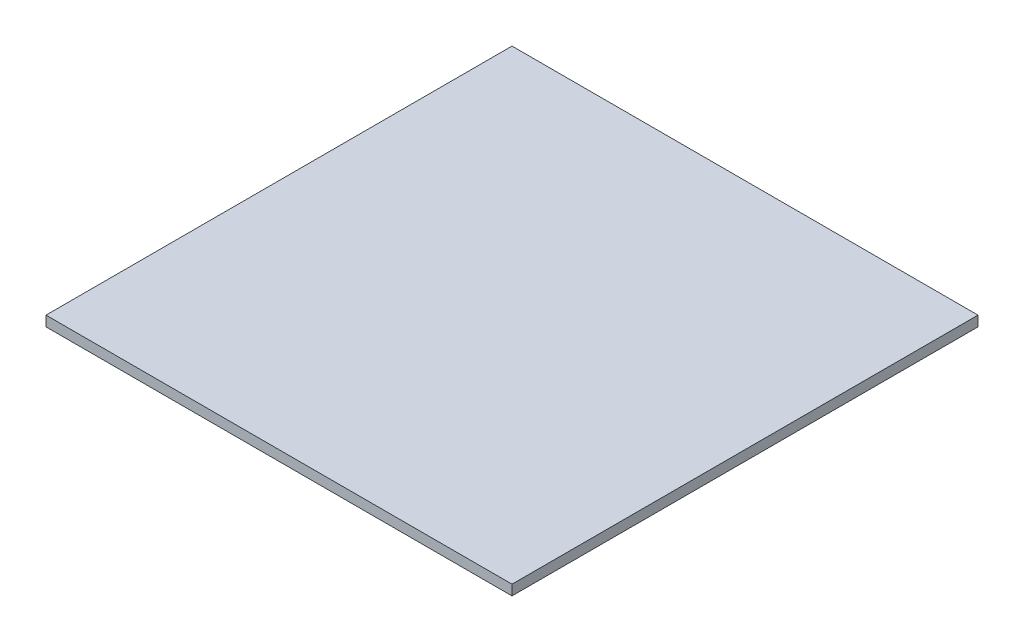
ISO-10303-21;
HEADER;
FILE_DESCRIPTION(('STEP AP214'),'2;1');
FILE_NAME('part.step','',(''),(''),'','','');
FILE_SCHEMA(('AUTOMOTIVE_DESIGN { 1 0 10303 214 1 1 1 1 }'));
ENDSEC;
DATA;
#1=APPLICATION_CONTEXT('core data for automotive mechanical design processes');
#2=APPLICATION_PROTOCOL_DEFINITION('international standard','automotive_design',2000,#1);
#3=PRODUCT_CONTEXT('',#1,'mechanical');
#4=PRODUCT('Part','Part','',(#3));
#5=PRODUCT_RELATED_PRODUCT_CATEGORY('part','',(#4));
#6=PRODUCT_DEFINITION_FORMATION('','',#4);
#7=PRODUCT_DEFINITION_CONTEXT('part definition',#1,'design');
#8=PRODUCT_DEFINITION('design','',#6,#7);
#9=PRODUCT_DEFINITION_SHAPE('','',#8);
#10=(LENGTH_UNIT() NAMED_UNIT(*) SI_UNIT(.MILLI.,.METRE.));
#11=(NAMED_UNIT(*) PLANE_ANGLE_UNIT() SI_UNIT($,.RADIAN.));
#12=(NAMED_UNIT(*) SI_UNIT($,.STERADIAN.) SOLID_ANGLE_UNIT());
#13=UNCERTAINTY_MEASURE_WITH_UNIT(LENGTH_MEASURE(1.E-05),#10,'distance_accuracy_value','');
#14=(GEOMETRIC_REPRESENTATION_CONTEXT(3) GLOBAL_UNCERTAINTY_ASSIGNED_CONTEXT((#13)) GLOBAL_UNIT_ASSIGNED_CONTEXT((#10,
#11,#12)) REPRESENTATION_CONTEXT('',''));
#15=CARTESIAN_POINT('',(0.,0.,0.));
#16=DIRECTION('',(0.,0.,1.));
#17=DIRECTION('',(1.,0.,0.));
#18=AXIS2_PLACEMENT_3D('',#15,#16,#17);
#19=CARTESIAN_POINT('',(-114.3,5.,114.3));
#20=DIRECTION('',(1.,0.,0.));
#21=DIRECTION('',(0.,0.,-1.));
#22=AXIS2_PLACEMENT_3D('',#19,#20,#21);
#23=PLANE('',#22);
#24=DIRECTION('',(0.,0.,1.));
#25=VECTOR('',#24,1.);
#26=CARTESIAN_POINT('',(-114.3,0.,114.3));
#27=LINE('',#26,#25);
#28=CARTESIAN_POINT('',(-114.3,0.,-114.3));
#29=VERTEX_POINT('',#28);
#30=CARTESIAN_POINT('',(-114.3,0.,114.3));
#31=VERTEX_POINT('',#30);
#32=EDGE_CURVE('E113',#29,#31,#27,.T.);
#33=ORIENTED_EDGE('',*,*,#32,.T.);
#34=DIRECTION('',(0.,-1.,0.));
#35=VECTOR('',#34,1.);
#36=CARTESIAN_POINT('',(-114.3,5.,114.3));
#37=LINE('',#36,#35);
#38=CARTESIAN_POINT('',(-114.3,5.,114.3));
#39=VERTEX_POINT('',#38);
#40=EDGE_CURVE('E11',#39,#31,#37,.T.);
#41=ORIENTED_EDGE('',*,*,#40,.F.);
#42=DIRECTION('',(0.,0.,1.));
#43=VECTOR('',#42,1.);
#44=CARTESIAN_POINT('',(-114.3,5.,114.3));
#45=LINE('',#44,#43);
#46=CARTESIAN_POINT('',(-114.3,5.,-114.3));
#47=VERTEX_POINT('',#46);
#48=EDGE_CURVE('E97',#47,#39,#45,.T.);
#49=ORIENTED_EDGE('',*,*,#48,.F.);
#50=DIRECTION('',(0.,-1.,0.));
#51=VECTOR('',#50,1.);
#52=CARTESIAN_POINT('',(-114.3,5.,-114.3));
#53=LINE('',#52,#51);
#54=EDGE_CURVE('E109',#47,#29,#53,.T.);
#55=ORIENTED_EDGE('',*,*,#54,.T.);
#56=EDGE_LOOP('',(#33,#41,#49,#55));
#57=FACE_BOUND('',#56,.T.);
#58=ADVANCED_FACE('F45',(#57),#23,.F.);
#59=CARTESIAN_POINT('',(114.3,5.,114.3));
#60=DIRECTION('',(0.,0.,-1.));
#61=DIRECTION('',(-1.,0.,0.));
#62=AXIS2_PLACEMENT_3D('',#59,#60,#61);
#63=PLANE('',#62);
#64=DIRECTION('',(1.,0.,0.));
#65=VECTOR('',#64,1.);
#66=CARTESIAN_POINT('',(114.3,0.,114.3));
#67=LINE('',#66,#65);
#68=CARTESIAN_POINT('',(114.3,0.,114.3));
#69=VERTEX_POINT('',#68);
#70=EDGE_CURVE('E102',#31,#69,#67,.T.);
#71=ORIENTED_EDGE('',*,*,#70,.T.);
#72=DIRECTION('',(0.,-1.,0.));
#73=VECTOR('',#72,1.);
#74=CARTESIAN_POINT('',(114.3,5.,114.3));
#75=LINE('',#74,#73);
#76=CARTESIAN_POINT('',(114.3,5.,114.3));
#77=VERTEX_POINT('',#76);
#78=EDGE_CURVE('E54',#77,#69,#75,.T.);
#79=ORIENTED_EDGE('',*,*,#78,.F.);
#80=DIRECTION('',(1.,0.,0.));
#81=VECTOR('',#80,1.);
#82=CARTESIAN_POINT('',(114.3,5.,114.3));
#83=LINE('',#82,#81);
#84=EDGE_CURVE('E92',#39,#77,#83,.T.);
#85=ORIENTED_EDGE('',*,*,#84,.F.);
#86=ORIENTED_EDGE('',*,*,#40,.T.);
#87=EDGE_LOOP('',(#71,#79,#85,#86));
#88=FACE_BOUND('',#87,.T.);
#89=ADVANCED_FACE('F101',(#88),#63,.F.);
#90=CARTESIAN_POINT('',(114.3,5.,114.3));
#91=DIRECTION('',(-1.,0.,0.));
#92=DIRECTION('',(0.,0.,1.));
#93=AXIS2_PLACEMENT_3D('',#90,#91,#92);
#94=PLANE('',#93);
#95=DIRECTION('',(0.,0.,-1.));
#96=VECTOR('',#95,1.);
#97=CARTESIAN_POINT('',(114.3,0.,114.3));
#98=LINE('',#97,#96);
#99=CARTESIAN_POINT('',(114.3,0.,-114.3));
#100=VERTEX_POINT('',#99);
#101=EDGE_CURVE('E79',#69,#100,#98,.T.);
#102=ORIENTED_EDGE('',*,*,#101,.T.);
#103=DIRECTION('',(0.,-1.,0.));
#104=VECTOR('',#103,1.);
#105=CARTESIAN_POINT('',(114.3,5.,-114.3));
#106=LINE('',#105,#104);
#107=CARTESIAN_POINT('',(114.3,5.,-114.3));
#108=VERTEX_POINT('',#107);
#109=EDGE_CURVE('E104',#108,#100,#106,.T.);
#110=ORIENTED_EDGE('',*,*,#109,.F.);
#111=DIRECTION('',(0.,0.,-1.));
#112=VECTOR('',#111,1.);
#113=CARTESIAN_POINT('',(114.3,5.,114.3));
#114=LINE('',#113,#112);
#115=EDGE_CURVE('E95',#77,#108,#114,.T.);
#116=ORIENTED_EDGE('',*,*,#115,.F.);
#117=ORIENTED_EDGE('',*,*,#78,.T.);
#118=EDGE_LOOP('',(#102,#110,#116,#117));
#119=FACE_BOUND('',#118,.T.);
#120=ADVANCED_FACE('F105',(#119),#94,.F.);
#121=CARTESIAN_POINT('',(114.3,5.,-114.3));
#122=DIRECTION('',(0.,0.,1.));
#123=DIRECTION('',(1.,0.,0.));
#124=AXIS2_PLACEMENT_3D('',#121,#122,#123);
#125=PLANE('',#124);
#126=DIRECTION('',(-1.,0.,0.));
#127=VECTOR('',#126,1.);
#128=CARTESIAN_POINT('',(114.3,0.,-114.3));
#129=LINE('',#128,#127);
#130=EDGE_CURVE('E85',#100,#29,#129,.T.);
#131=ORIENTED_EDGE('',*,*,#130,.T.);
#132=ORIENTED_EDGE('',*,*,#54,.F.);
#133=DIRECTION('',(-1.,0.,0.));
#134=VECTOR('',#133,1.);
#135=CARTESIAN_POINT('',(114.3,5.,-114.3));
#136=LINE('',#135,#134);
#137=EDGE_CURVE('E62',#108,#47,#136,.T.);
#138=ORIENTED_EDGE('',*,*,#137,.F.);
#139=ORIENTED_EDGE('',*,*,#109,.T.);
#140=EDGE_LOOP('',(#131,#132,#138,#139));
#141=FACE_BOUND('',#140,.T.);
#142=ADVANCED_FACE('F126',(#141),#125,.F.);
#143=CARTESIAN_POINT('',(0.,5.,0.));
#144=DIRECTION('',(0.,1.,0.));
#145=DIRECTION('',(0.,0.,1.));
#146=AXIS2_PLACEMENT_3D('',#143,#144,#145);
#147=PLANE('',#146);
#148=ORIENTED_EDGE('',*,*,#48,.T.);
#149=ORIENTED_EDGE('',*,*,#84,.T.);
#150=ORIENTED_EDGE('',*,*,#115,.T.);
#151=ORIENTED_EDGE('',*,*,#137,.T.);
#152=EDGE_LOOP('',(#148,#149,#150,#151));
#153=FACE_BOUND('',#152,.T.);
#154=ADVANCED_FACE('F93',(#153),#147,.T.);
#155=CARTESIAN_POINT('',(0.,0.,0.));
#156=DIRECTION('',(0.,1.,0.));
#157=DIRECTION('',(0.,0.,1.));
#158=AXIS2_PLACEMENT_3D('',#155,#156,#157);
#159=PLANE('',#158);
#160=ORIENTED_EDGE('',*,*,#32,.F.);
#161=ORIENTED_EDGE('',*,*,#130,.F.);
#162=ORIENTED_EDGE('',*,*,#101,.F.);
#163=ORIENTED_EDGE('',*,*,#70,.F.);
#164=EDGE_LOOP('',(#160,#161,#162,#163));
#165=FACE_BOUND('',#164,.T.);
#166=ADVANCED_FACE('F129',(#165),#159,.F.);
#167=CLOSED_SHELL('',(#58,#89,#120,#142,#154,#166));
#168=MANIFOLD_SOLID_BREP('B2',#167);
#169=ADVANCED_BREP_SHAPE_REPRESENTATION('',(#18,#168),#14);
#170=SHAPE_DEFINITION_REPRESENTATION(#9,#169);
ENDSEC;
END-ISO-10303-21;
